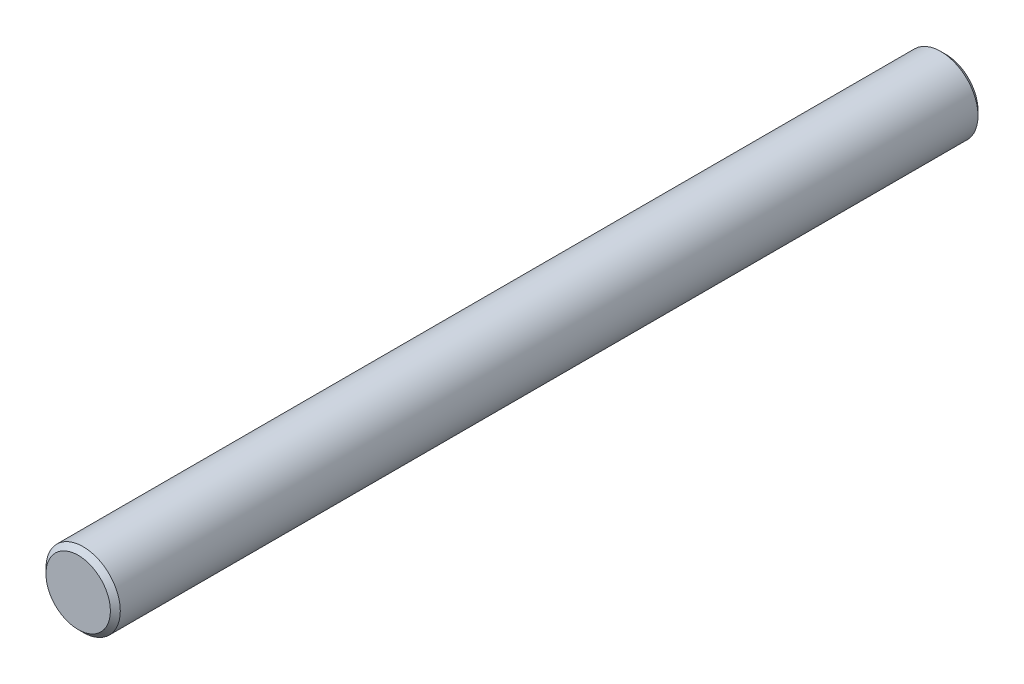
ISO-10303-21;
HEADER;
FILE_DESCRIPTION(('STEP AP214'),'2;1');
FILE_NAME('part.step','',(''),(''),'','','');
FILE_SCHEMA(('AUTOMOTIVE_DESIGN { 1 0 10303 214 1 1 1 1 }'));
ENDSEC;
DATA;
#1=APPLICATION_CONTEXT('core data for automotive mechanical design processes');
#2=APPLICATION_PROTOCOL_DEFINITION('international standard','automotive_design',2000,#1);
#3=PRODUCT_CONTEXT('',#1,'mechanical');
#4=PRODUCT('Part','Part','',(#3));
#5=PRODUCT_RELATED_PRODUCT_CATEGORY('part','',(#4));
#6=PRODUCT_DEFINITION_FORMATION('','',#4);
#7=PRODUCT_DEFINITION_CONTEXT('part definition',#1,'design');
#8=PRODUCT_DEFINITION('design','',#6,#7);
#9=PRODUCT_DEFINITION_SHAPE('','',#8);
#10=(LENGTH_UNIT() NAMED_UNIT(*) SI_UNIT(.MILLI.,.METRE.));
#11=(NAMED_UNIT(*) PLANE_ANGLE_UNIT() SI_UNIT($,.RADIAN.));
#12=(NAMED_UNIT(*) SI_UNIT($,.STERADIAN.) SOLID_ANGLE_UNIT());
#13=UNCERTAINTY_MEASURE_WITH_UNIT(LENGTH_MEASURE(1.E-05),#10,'distance_accuracy_value','');
#14=(GEOMETRIC_REPRESENTATION_CONTEXT(3) GLOBAL_UNCERTAINTY_ASSIGNED_CONTEXT((#13)) GLOBAL_UNIT_ASSIGNED_CONTEXT((#10,
#11,#12)) REPRESENTATION_CONTEXT('',''));
#15=CARTESIAN_POINT('',(0.,0.,0.));
#16=DIRECTION('',(0.,0.,1.));
#17=DIRECTION('',(1.,0.,0.));
#18=AXIS2_PLACEMENT_3D('',#15,#16,#17);
#19=CARTESIAN_POINT('',(0.,0.,35.));
#20=DIRECTION('',(0.,0.,-1.));
#21=DIRECTION('',(-1.,0.,0.));
#22=AXIS2_PLACEMENT_3D('',#19,#20,#21);
#23=CYLINDRICAL_SURFACE('',#22,1.5);
#24=CARTESIAN_POINT('',(0.,0.,34.8));
#25=DIRECTION('',(0.,0.,1.));
#26=DIRECTION('',(1.,0.,0.));
#27=AXIS2_PLACEMENT_3D('',#24,#25,#26);
#28=CIRCLE('',#27,1.5);
#29=CARTESIAN_POINT('',(1.5,0.,34.8));
#30=VERTEX_POINT('',#29);
#31=EDGE_CURVE('E42',#30,#30,#28,.F.);
#32=ORIENTED_EDGE('',*,*,#31,.T.);
#33=EDGE_LOOP('',(#32));
#34=FACE_BOUND('',#33,.T.);
#35=CARTESIAN_POINT('',(0.,0.,0.200000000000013));
#36=DIRECTION('',(0.,0.,1.));
#37=DIRECTION('',(1.,0.,0.));
#38=AXIS2_PLACEMENT_3D('',#35,#36,#37);
#39=CIRCLE('',#38,1.5);
#40=CARTESIAN_POINT('',(1.5,0.,0.200000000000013));
#41=VERTEX_POINT('',#40);
#42=EDGE_CURVE('E46',#41,#41,#39,.T.);
#43=ORIENTED_EDGE('',*,*,#42,.T.);
#44=EDGE_LOOP('',(#43));
#45=FACE_BOUND('',#44,.T.);
#46=ADVANCED_FACE('F35',(#34,#45),#23,.T.);
#47=CARTESIAN_POINT('',(0.,0.,35.));
#48=DIRECTION('',(0.,0.,1.));
#49=DIRECTION('',(1.,0.,0.));
#50=AXIS2_PLACEMENT_3D('',#47,#48,#49);
#51=PLANE('',#50);
#52=CARTESIAN_POINT('',(0.,0.,35.));
#53=DIRECTION('',(0.,0.,1.));
#54=DIRECTION('',(1.,0.,0.));
#55=AXIS2_PLACEMENT_3D('',#52,#53,#54);
#56=CIRCLE('',#55,1.30000000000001);
#57=CARTESIAN_POINT('',(1.30000000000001,0.,35.));
#58=VERTEX_POINT('',#57);
#59=EDGE_CURVE('E50',#58,#58,#56,.T.);
#60=ORIENTED_EDGE('',*,*,#59,.T.);
#61=EDGE_LOOP('',(#60));
#62=FACE_BOUND('',#61,.T.);
#63=ADVANCED_FACE('F56',(#62),#51,.T.);
#64=CARTESIAN_POINT('',(0.,0.,0.));
#65=DIRECTION('',(0.,0.,1.));
#66=DIRECTION('',(1.,0.,0.));
#67=AXIS2_PLACEMENT_3D('',#64,#65,#66);
#68=PLANE('',#67);
#69=CARTESIAN_POINT('',(0.,0.,0.));
#70=DIRECTION('',(0.,0.,1.));
#71=DIRECTION('',(1.,0.,0.));
#72=AXIS2_PLACEMENT_3D('',#69,#70,#71);
#73=CIRCLE('',#72,1.29999999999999);
#74=CARTESIAN_POINT('',(1.29999999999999,0.,0.));
#75=VERTEX_POINT('',#74);
#76=EDGE_CURVE('E10',#75,#75,#73,.F.);
#77=ORIENTED_EDGE('',*,*,#76,.T.);
#78=EDGE_LOOP('',(#77));
#79=FACE_BOUND('',#78,.T.);
#80=ADVANCED_FACE('F60',(#79),#68,.F.);
#81=CARTESIAN_POINT('',(0.,0.,35.));
#82=DIRECTION('',(0.,0.,-1.));
#83=DIRECTION('',(-1.,0.,0.));
#84=AXIS2_PLACEMENT_3D('',#81,#82,#83);
#85=CONICAL_SURFACE('',#84,1.30000000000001,0.78539816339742);
#86=ORIENTED_EDGE('',*,*,#31,.F.);
#87=EDGE_LOOP('',(#86));
#88=FACE_BOUND('',#87,.T.);
#89=ORIENTED_EDGE('',*,*,#59,.F.);
#90=EDGE_LOOP('',(#89));
#91=FACE_BOUND('',#90,.T.);
#92=ADVANCED_FACE('F58',(#88,#91),#85,.T.);
#93=CARTESIAN_POINT('',(0.,0.,0.200000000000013));
#94=DIRECTION('',(0.,0.,1.));
#95=DIRECTION('',(1.,0.,0.));
#96=AXIS2_PLACEMENT_3D('',#93,#94,#95);
#97=CONICAL_SURFACE('',#96,1.5,0.785398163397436);
#98=ORIENTED_EDGE('',*,*,#76,.F.);
#99=EDGE_LOOP('',(#98));
#100=FACE_BOUND('',#99,.T.);
#101=ORIENTED_EDGE('',*,*,#42,.F.);
#102=EDGE_LOOP('',(#101));
#103=FACE_BOUND('',#102,.T.);
#104=ADVANCED_FACE('F37',(#100,#103),#97,.T.);
#105=CLOSED_SHELL('',(#46,#63,#80,#92,#104));
#106=MANIFOLD_SOLID_BREP('B2',#105);
#107=ADVANCED_BREP_SHAPE_REPRESENTATION('',(#18,#106),#14);
#108=SHAPE_DEFINITION_REPRESENTATION(#9,#107);
ENDSEC;
END-ISO-10303-21;
